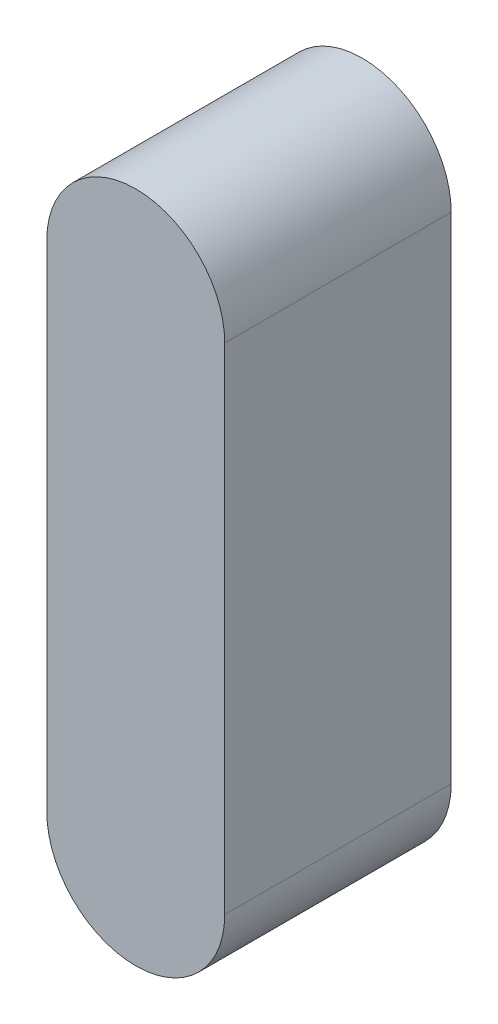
from build123d import *

# Parameters (mm, degrees)
BOSS_EXTRUDE1_DEPTH = 8.89


with BuildPart() as part:
    # Sketch1 → Boss-Extrude1 (new body)
    with BuildSketch(Plane.XY):
        with BuildLine():
            Line((3.4925, 9.7155), (3.4925, -9.7155))
            ThreePointArc((3.4925, -9.7155), (0, -13.208), (-3.4925, -9.7155))
            Line((-3.4925, -9.7155), (-3.4925, 9.7155))
            ThreePointArc((-3.4925, 9.7155), (0, 13.208), (3.4925, 9.7155))
        make_face()
    extrude(amount=BOSS_EXTRUDE1_DEPTH)


solid = part.part
